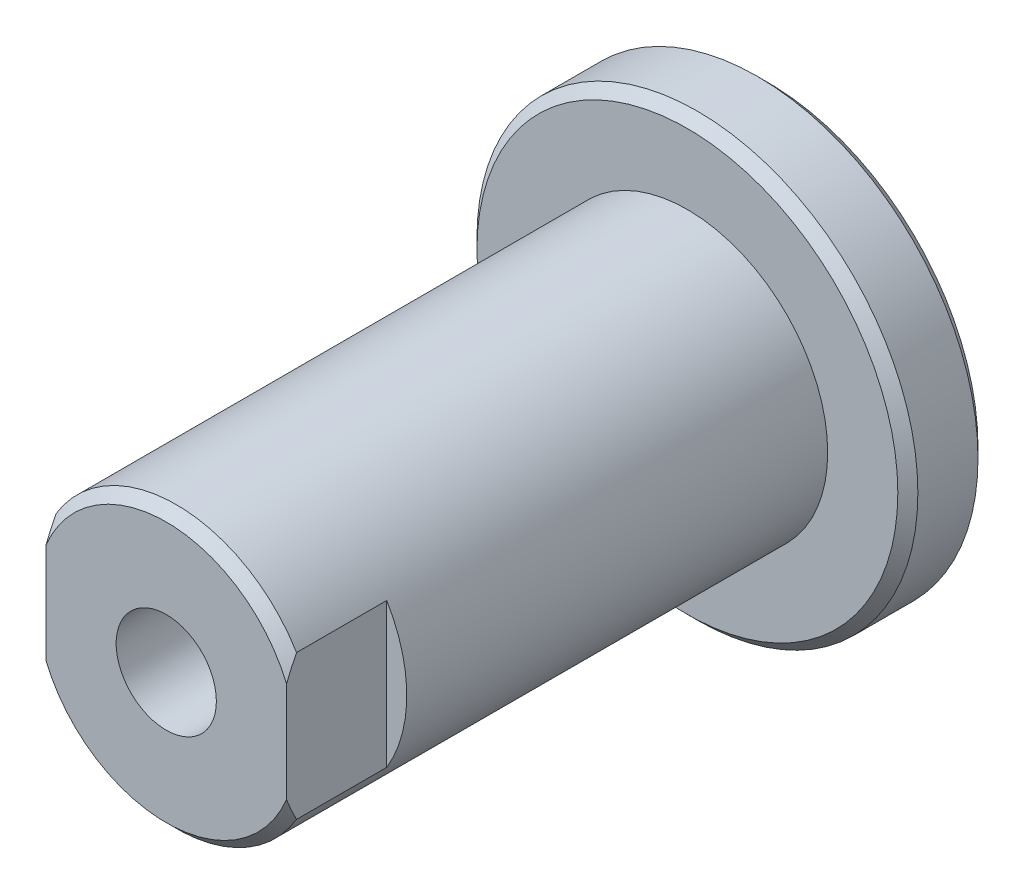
from build123d import *

# Parameters (mm, degrees)
ESQUISSE1_R             = 11
EXTRUSION1_DEPTH        = 4
ESQUISSE2_R             = 7
EXTRUSION2_DEPTH        = 26
CHANFREIN2_SIZE         = 0.5
ESQUISSE3_W             = 8.70842535
ESQUISSE3_H             = 21.848357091
ESQUISSE3_W_2           = 7.471725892
ESQUISSE3_H_2           = 24.424814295
ENL_V_MAT_EXTRU_1_DEPTH = 5
TROU_TARAUD_M61_D       = 5


with BuildPart() as part:
    # Esquisse1 → Extrusion1 (new body)
    with BuildSketch(Plane.XY):
        Circle(ESQUISSE1_R)
    extrude(amount=EXTRUSION1_DEPTH)

    # Esquisse2 → Extrusion2 (add)
    with BuildSketch(Plane.XY.offset(4)):
        Circle(ESQUISSE2_R)
    extrude(amount=EXTRUSION2_DEPTH)

    # Chanfrein2
    chanfrein2_edges = [part.edges().sort_by_distance(p)[0] for p in [
        (-11, 0, 0),
        (-11, 0, 4),
        (-7, 0, 30),
    ]]
    chamfer(chanfrein2_edges, length=CHANFREIN2_SIZE)

    # Esquisse3 → Enl_v. mat.-Extru.1 (cut)
    with BuildSketch(Plane.XY.offset(30)):
        with Locations((10.354212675, 0.309174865)):
            Rectangle(ESQUISSE3_W, ESQUISSE3_H)
        with Locations((-9.735862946, 1.597403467)):
            Rectangle(ESQUISSE3_W_2, ESQUISSE3_H_2)
    extrude(amount=-ENL_V_MAT_EXTRU_1_DEPTH, mode=Mode.SUBTRACT)

    # Trou taraud_ M61 (through all)
    with Locations(Plane.XY.offset(30)):
        with Locations((0, 0)):
            Hole(TROU_TARAUD_M61_D / 2)


solid = part.part
